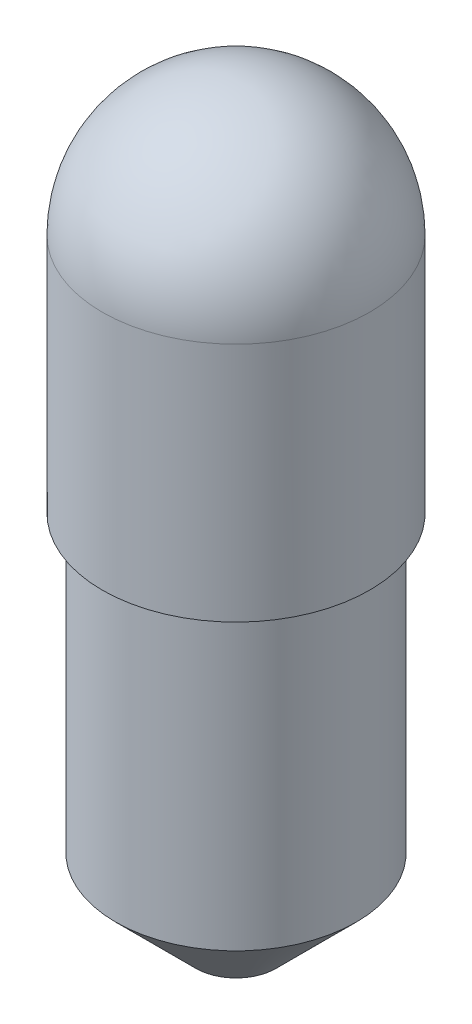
from build123d import *


with BuildPart() as part:
    # Esquisse1 → R_volution4 (revolve)
    with BuildSketch(Plane.XY, mode=Mode.PRIVATE) as r_volution4_sk:
        with BuildLine():
            Line((0, 0), (-1.5, 0))
            Line((-1.5, 0), (-4.5, 3))
            Line((-4.5, 3), (-4.5, 14))
            Line((-4.5, 14), (-5, 14))
            Line((-5, 14), (-5, 23))
            ThreePointArc((-5, 23), (-3.535533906, 26.535533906), (0, 28))
            Line((0, 28), (0, 0))
        make_face()
    revolve(r_volution4_sk.sketch.rotate(Axis((0, 45.351884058, 0), (0, -1, 0)), 270), axis=Axis((0, 45.351884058, 0), (0, -1, 0)))


solid = part.part
